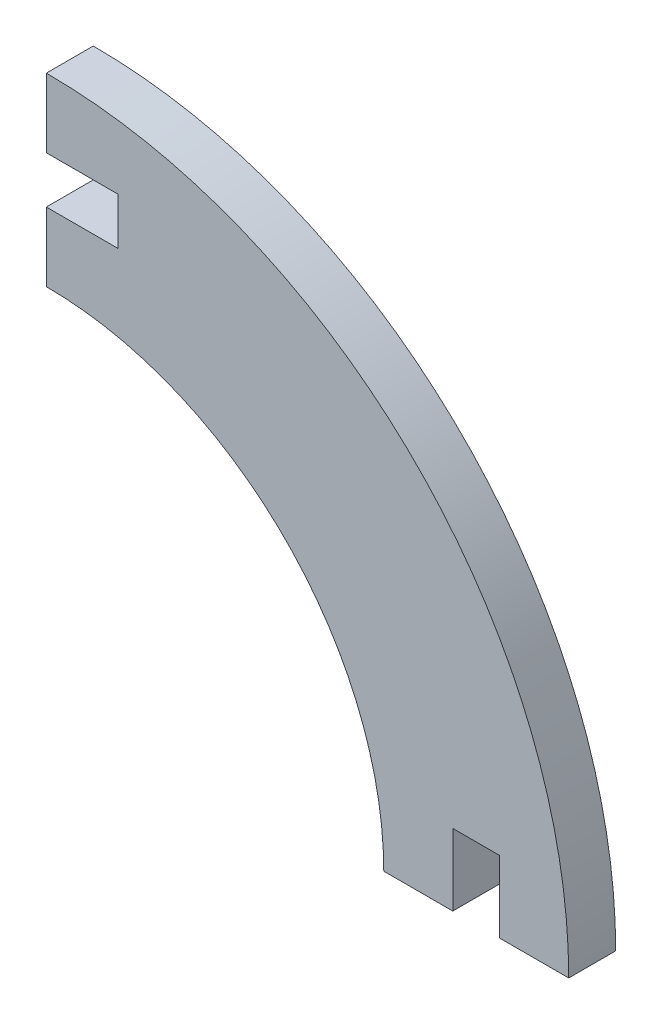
from build123d import *

# Parameters (mm, degrees)
BOSS_EXTRUDE1_DEPTH = 3.999992


with BuildPart() as part:
    # Sketch1 → Boss-Extrude1 (new body)
    with BuildSketch(Plane.XY):
        with BuildLine():
            Line((-37.533805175, 28.736819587), (-37.533805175, 34.610823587))
            Line((-37.533805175, 34.610823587), (-31.437805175, 34.610823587))
            Line((-31.437805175, 34.610823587), (-31.437805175, 38.610823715))
            Line((-31.437805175, 38.610823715), (-37.533805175, 38.610823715))
            Line((-37.533805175, 38.610823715), (-37.533805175, 44.484827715))
            ThreePointArc((-37.533805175, 44.484827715), (-6.078281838, 31.455523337), (6.95102254, 0))
            Line((6.95102254, 0), (1.07701854, 0))
            Line((1.07701854, 0), (1.07701854, 6.096))
            Line((1.07701854, 6.096), (-2.922981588, 6.096))
            Line((-2.922981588, 6.096), (-2.922981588, 0))
            Line((-2.922981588, 0), (-8.796985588, 0))
            ThreePointArc((-8.796985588, 0), (-17.213805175, 20.32), (-37.533805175, 28.736819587))
        make_face()
    extrude(amount=BOSS_EXTRUDE1_DEPTH)


solid = part.part
